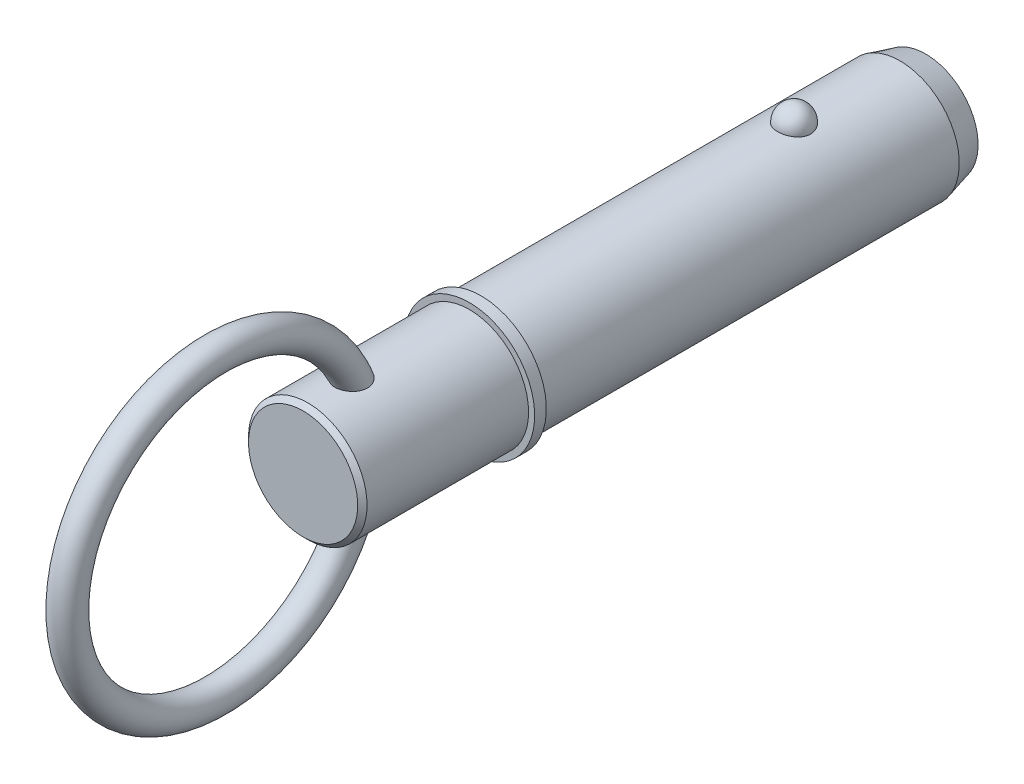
from build123d import *

# Parameters (mm, degrees)
SKETCH2_R           = 12.7
BOSS_EXTRUDE1_DEPTH = 63.5
BOSS_EXTRUDE2_START = 31.75
SKETCH3_R           = 12.7
BOSS_EXTRUDE2_DEPTH = 31.75
CHAMFER1_SIZE       = 5.5
CHAMFER1_SIZE2      = 1.473720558
SKETCH20_W          = 2.5
SKETCH20_H          = 14
SKETCH21_R          = 12.7
BOSS_EXTRUDE3_DEPTH = 38.1
CHAMFER2_SIZE       = 1
SKETCH24_R          = 3.25


with BuildPart() as part:
    # Sketch2 → Boss-Extrude1 (new body)
    with BuildSketch(Plane.XY):
        Circle(SKETCH2_R)
    extrude(amount=BOSS_EXTRUDE1_DEPTH)

    # Sketch3 → Boss-Extrude2 (add)
    with BuildSketch(Plane(origin=(0, 0, 0), x_dir=(-1, 0, 0), z_dir=(0, 0, -1)).offset(BOSS_EXTRUDE2_START)):
        Circle(SKETCH3_R)
    extrude(amount=-BOSS_EXTRUDE2_DEPTH)

    # Chamfer1
    chamfer1_edges = [part.edges().sort_by_distance(p)[0] for p in [
        (12.7, 0, -31.75),
    ]]
    chamfer1_side = [part.faces().sort_by_distance(p)[0] for p in [
        (12.7, 0, -15.875),
    ]]
    chamfer(chamfer1_edges, length=CHAMFER1_SIZE, length2=CHAMFER1_SIZE2, reference=chamfer1_side[0])

    # Sketch18 → Revolve1 (revolve)
    with BuildSketch(Plane(origin=(0, 0, 0), x_dir=(0, 0, -1), z_dir=(1, 0, 0))):
        with BuildLine():
            Line((3.56, 16.26), (3.56, 9.14))
            ThreePointArc((3.56, 9.14), (0, 12.7), (3.56, 16.26))
        make_face()
    revolve(axis=Axis((0, 16.26, -3.56), (0, -1, 0)))

    # Sketch20 → Revolve2 (revolve)
    with BuildSketch(Plane(origin=(0, 0, 0), x_dir=(0, 0, -1), z_dir=(1, 0, 0)), mode=Mode.PRIVATE) as revolve2_sk:
        with Locations((-64.75, 7)):
            Rectangle(SKETCH20_W, SKETCH20_H)
    revolve(revolve2_sk.sketch.rotate(Axis((0, 0, 33.728787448), (0, 0, 1)), 90), axis=Axis((0, 0, 33.728787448), (0, 0, 1)))

    # Sketch21 → Boss-Extrude3 (add)
    with BuildSketch(Plane(origin=(0, 0, 63.5), x_dir=(-1, 0, 0), z_dir=(0, 0, -1))):
        Circle(SKETCH21_R)
    extrude(amount=-BOSS_EXTRUDE3_DEPTH)

    # Chamfer2
    chamfer2_edges = [part.edges().sort_by_distance(p)[0] for p in [
        (12.7, 0, 101.6),
    ]]
    chamfer(chamfer2_edges, length=CHAMFER2_SIZE)

    # Sweep1: sweep along a path in Sketch23
    with BuildLine(Plane(origin=(0, 0, 0), x_dir=(0, 0, -1), z_dir=(1, 0, 0))) as sweep1_path:
        CenterArc((-120.35, 0), 31.75, 0, 360)
    # Sketch24 → Sweep1 (sweep)
    with BuildSketch(Plane(origin=(0, 0, 0), x_dir=(1, 0, 0), z_dir=(0, 1, 0))):
        with Locations((0, -88.6)):
            Circle(SKETCH24_R)
    sweep(path=sweep1_path.line)


solid = part.part
